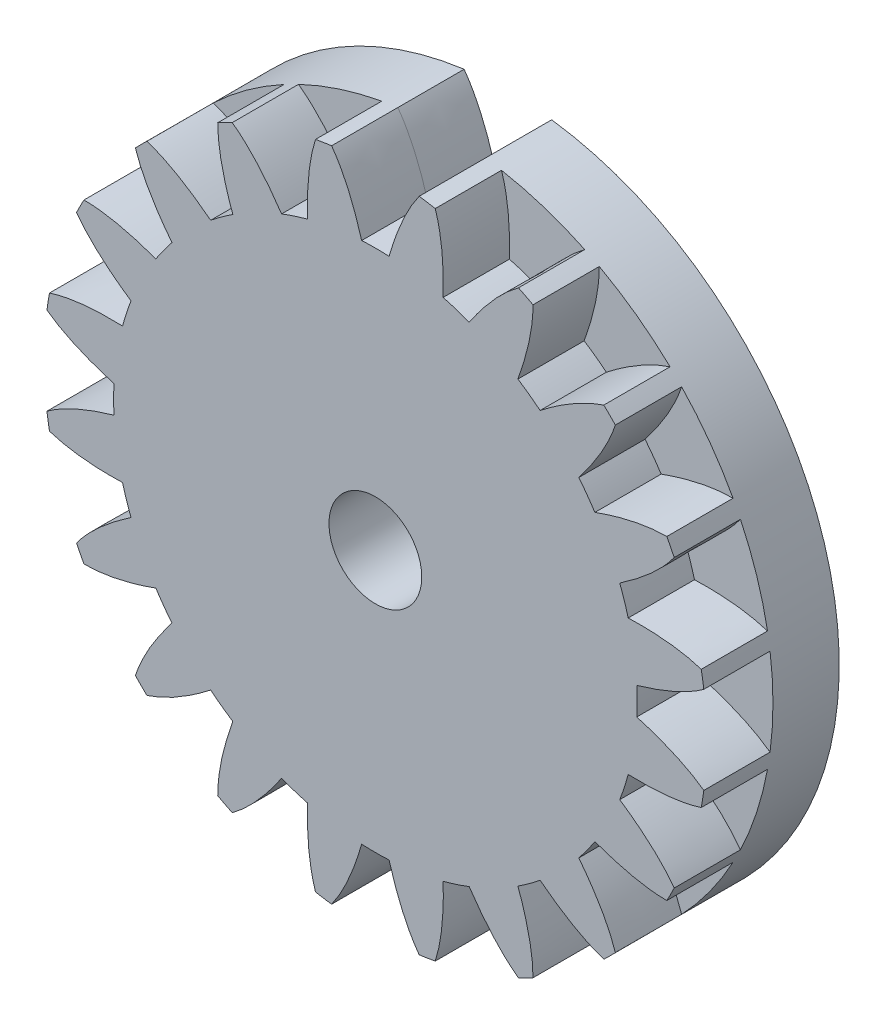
from build123d import *

# Parameters (mm, degrees)
SKETCH_3_R      = 7
EXTRUDE_1_DEPTH = 10
EXTRUDE_START   = -10
SKETCH_4_R      = 7
EXTRUDE_2_DEPTH = 10


with BuildPart() as part:
    # Sketch 3 → Extrude 1 (new body)
    with BuildSketch(Plane.XY):
        with BuildLine():
            ThreePointArc((2.067270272, 39.445866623), (0, 39.5), (-2.067270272, 39.445866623))
            add(Edge.make_bspline(
                [(-2.067270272, 39.445866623), (-3.939430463, 45.907422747), (-6.604591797, 49.561874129)],
                knots=[0, 0, 0, 1, 1, 1], degree=2))
            ThreePointArc((-6.604591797, 49.561874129), (-7.821723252, 49.38441703), (-9.034121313, 49.177074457))
            add(Edge.make_bspline(
                [(-10.223352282, 38.154070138), (-10.439552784, 44.877904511), (-9.034121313, 49.177074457)],
                knots=[0, 0, 0, 1, 1, 1], degree=2))
            ThreePointArc((-10.223352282, 38.154070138), (-12.206171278, 37.566732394), (-14.155534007, 36.876426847))
            add(Edge.make_bspline(
                [(-14.155534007, 36.876426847), (-17.932794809, 42.443202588), (-21.596801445, 45.095212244)],
                knots=[0, 0, 0, 1, 1, 1], degree=2))
            ThreePointArc((-21.596801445, 45.095212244), (-22.699524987, 44.550326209), (-23.788511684, 43.978480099))
            add(Edge.make_bspline(
                [(-21.513241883, 33.127487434), (-23.796639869, 39.455424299), (-23.788511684, 43.978480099)],
                knots=[0, 0, 0, 1, 1, 1], degree=2))
            ThreePointArc((-21.513241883, 33.127487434), (-23.217517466, 31.956171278), (-24.858155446, 30.697265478))
            add(Edge.make_bspline(
                [(-24.858155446, 30.697265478), (-30.170772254, 34.824346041), (-34.474965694, 36.214316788)],
                knots=[0, 0, 0, 1, 1, 1], degree=2))
            ThreePointArc((-34.474965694, 36.214316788), (-35.355339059, 35.355339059), (-36.214316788, 34.474965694))
            add(Edge.make_bspline(
                [(-30.697265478, 24.858155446), (-34.824346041, 30.170772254), (-36.214316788, 34.474965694)],
                knots=[0, 0, 0, 1, 1, 1], degree=2))
            ThreePointArc((-30.697265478, 24.858155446), (-31.956171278, 23.217517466), (-33.127487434, 21.513241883))
            add(Edge.make_bspline(
                [(-33.127487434, 21.513241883), (-39.455424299, 23.796639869), (-43.978480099, 23.788511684)],
                knots=[0, 0, 0, 1, 1, 1], degree=2))
            ThreePointArc((-43.978480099, 23.788511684), (-44.550326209, 22.699524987), (-45.095212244, 21.596801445))
            add(Edge.make_bspline(
                [(-36.876426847, 14.155534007), (-42.443202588, 17.932794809), (-45.095212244, 21.596801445)],
                knots=[0, 0, 0, 1, 1, 1], degree=2))
            ThreePointArc((-36.876426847, 14.155534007), (-37.566732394, 12.206171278), (-38.154070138, 10.223352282))
            add(Edge.make_bspline(
                [(-38.154070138, 10.223352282), (-44.877904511, 10.439552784), (-49.177074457, 9.034121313)],
                knots=[0, 0, 0, 1, 1, 1], degree=2))
            ThreePointArc((-49.177074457, 9.034121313), (-49.38441703, 7.821723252), (-49.561874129, 6.604591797))
            add(Edge.make_bspline(
                [(-39.445866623, 2.067270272), (-45.907422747, 3.939430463), (-49.561874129, 6.604591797)],
                knots=[0, 0, 0, 1, 1, 1], degree=2))
            ThreePointArc((-39.445866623, 2.067270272), (-39.5, 0), (-39.445866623, -2.067270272))
            add(Edge.make_bspline(
                [(-39.445866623, -2.067270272), (-45.907422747, -3.939430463), (-49.561874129, -6.604591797)],
                knots=[0, 0, 0, 1, 1, 1], degree=2))
            ThreePointArc((-49.561874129, -6.604591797), (-49.38441703, -7.821723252), (-49.177074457, -9.034121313))
            add(Edge.make_bspline(
                [(-38.154070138, -10.223352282), (-44.877904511, -10.439552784), (-49.177074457, -9.034121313)],
                knots=[0, 0, 0, 1, 1, 1], degree=2))
            ThreePointArc((-38.154070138, -10.223352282), (-37.566732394, -12.206171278), (-36.876426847, -14.155534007))
            add(Edge.make_bspline(
                [(-36.876426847, -14.155534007), (-42.443202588, -17.932794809), (-45.095212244, -21.596801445)],
                knots=[0, 0, 0, 1, 1, 1], degree=2))
            ThreePointArc((-45.095212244, -21.596801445), (-44.550326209, -22.699524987), (-43.978480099, -23.788511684))
            add(Edge.make_bspline(
                [(-33.127487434, -21.513241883), (-39.455424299, -23.796639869), (-43.978480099, -23.788511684)],
                knots=[0, 0, 0, 1, 1, 1], degree=2))
            ThreePointArc((-33.127487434, -21.513241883), (-31.956171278, -23.217517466), (-30.697265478, -24.858155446))
            add(Edge.make_bspline(
                [(-30.697265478, -24.858155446), (-34.824346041, -30.170772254), (-36.214316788, -34.474965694)],
                knots=[0, 0, 0, 1, 1, 1], degree=2))
            ThreePointArc((-36.214316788, -34.474965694), (-35.355339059, -35.355339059), (-34.474965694, -36.214316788))
            add(Edge.make_bspline(
                [(-24.858155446, -30.697265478), (-30.170772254, -34.824346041), (-34.474965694, -36.214316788)],
                knots=[0, 0, 0, 1, 1, 1], degree=2))
            ThreePointArc((-24.858155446, -30.697265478), (-23.217517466, -31.956171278), (-21.513241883, -33.127487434))
            add(Edge.make_bspline(
                [(-21.513241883, -33.127487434), (-23.796639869, -39.455424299), (-23.788511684, -43.978480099)],
                knots=[0, 0, 0, 1, 1, 1], degree=2))
            ThreePointArc((-23.788511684, -43.978480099), (-22.699524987, -44.550326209), (-21.596801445, -45.095212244))
            add(Edge.make_bspline(
                [(-14.155534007, -36.876426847), (-17.932794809, -42.443202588), (-21.596801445, -45.095212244)],
                knots=[0, 0, 0, 1, 1, 1], degree=2))
            ThreePointArc((-14.155534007, -36.876426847), (-12.206171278, -37.566732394), (-10.223352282, -38.154070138))
            add(Edge.make_bspline(
                [(-10.223352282, -38.154070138), (-10.439552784, -44.877904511), (-9.034121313, -49.177074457)],
                knots=[0, 0, 0, 1, 1, 1], degree=2))
            ThreePointArc((-9.034121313, -49.177074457), (-7.821723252, -49.38441703), (-6.604591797, -49.561874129))
            add(Edge.make_bspline(
                [(-2.067270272, -39.445866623), (-3.939430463, -45.907422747), (-6.604591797, -49.561874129)],
                knots=[0, 0, 0, 1, 1, 1], degree=2))
            ThreePointArc((-2.067270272, -39.445866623), (0, -39.5), (2.067270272, -39.445866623))
            add(Edge.make_bspline(
                [(2.067270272, -39.445866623), (3.939430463, -45.907422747), (6.604591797, -49.561874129)],
                knots=[0, 0, 0, 1, 1, 1], degree=2))
            ThreePointArc((6.604591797, -49.561874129), (7.821723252, -49.38441703), (9.034121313, -49.177074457))
            add(Edge.make_bspline(
                [(10.223352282, -38.154070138), (10.439552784, -44.877904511), (9.034121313, -49.177074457)],
                knots=[0, 0, 0, 1, 1, 1], degree=2))
            ThreePointArc((10.223352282, -38.154070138), (12.206171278, -37.566732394), (14.155534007, -36.876426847))
            add(Edge.make_bspline(
                [(14.155534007, -36.876426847), (17.932794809, -42.443202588), (21.596801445, -45.095212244)],
                knots=[0, 0, 0, 1, 1, 1], degree=2))
            ThreePointArc((21.596801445, -45.095212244), (22.699524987, -44.550326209), (23.788511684, -43.978480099))
            add(Edge.make_bspline(
                [(21.513241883, -33.127487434), (23.796639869, -39.455424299), (23.788511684, -43.978480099)],
                knots=[0, 0, 0, 1, 1, 1], degree=2))
            ThreePointArc((21.513241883, -33.127487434), (23.217517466, -31.956171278), (24.858155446, -30.697265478))
            add(Edge.make_bspline(
                [(24.858155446, -30.697265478), (30.170772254, -34.824346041), (34.474965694, -36.214316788)],
                knots=[0, 0, 0, 1, 1, 1], degree=2))
            ThreePointArc((34.474965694, -36.214316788), (35.355339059, -35.355339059), (36.214316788, -34.474965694))
            add(Edge.make_bspline(
                [(30.697265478, -24.858155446), (34.824346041, -30.170772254), (36.214316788, -34.474965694)],
                knots=[0, 0, 0, 1, 1, 1], degree=2))
            ThreePointArc((30.697265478, -24.858155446), (31.956171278, -23.217517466), (33.127487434, -21.513241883))
            add(Edge.make_bspline(
                [(33.127487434, -21.513241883), (39.455424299, -23.796639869), (43.978480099, -23.788511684)],
                knots=[0, 0, 0, 1, 1, 1], degree=2))
            ThreePointArc((43.978480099, -23.788511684), (44.550326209, -22.699524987), (45.095212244, -21.596801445))
            add(Edge.make_bspline(
                [(36.876426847, -14.155534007), (42.443202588, -17.932794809), (45.095212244, -21.596801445)],
                knots=[0, 0, 0, 1, 1, 1], degree=2))
            ThreePointArc((36.876426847, -14.155534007), (37.566732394, -12.206171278), (38.154070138, -10.223352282))
            add(Edge.make_bspline(
                [(38.154070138, -10.223352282), (44.877904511, -10.439552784), (49.177074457, -9.034121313)],
                knots=[0, 0, 0, 1, 1, 1], degree=2))
            ThreePointArc((49.177074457, -9.034121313), (49.38441703, -7.821723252), (49.561874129, -6.604591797))
            add(Edge.make_bspline(
                [(39.445866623, -2.067270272), (45.907422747, -3.939430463), (49.561874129, -6.604591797)],
                knots=[0, 0, 0, 1, 1, 1], degree=2))
            ThreePointArc((39.445866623, -2.067270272), (39.5, 0), (39.445866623, 2.067270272))
            add(Edge.make_bspline(
                [(39.445866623, 2.067270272), (45.907422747, 3.939430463), (49.561874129, 6.604591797)],
                knots=[0, 0, 0, 1, 1, 1], degree=2))
            ThreePointArc((49.561874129, 6.604591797), (49.38441703, 7.821723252), (49.177074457, 9.034121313))
            add(Edge.make_bspline(
                [(38.154070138, 10.223352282), (44.877904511, 10.439552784), (49.177074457, 9.034121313)],
                knots=[0, 0, 0, 1, 1, 1], degree=2))
            ThreePointArc((38.154070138, 10.223352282), (37.566732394, 12.206171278), (36.876426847, 14.155534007))
            add(Edge.make_bspline(
                [(36.876426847, 14.155534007), (42.443202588, 17.932794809), (45.095212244, 21.596801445)],
                knots=[0, 0, 0, 1, 1, 1], degree=2))
            ThreePointArc((45.095212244, 21.596801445), (44.550326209, 22.699524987), (43.978480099, 23.788511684))
            add(Edge.make_bspline(
                [(33.127487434, 21.513241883), (39.455424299, 23.796639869), (43.978480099, 23.788511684)],
                knots=[0, 0, 0, 1, 1, 1], degree=2))
            ThreePointArc((33.127487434, 21.513241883), (31.956171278, 23.217517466), (30.697265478, 24.858155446))
            add(Edge.make_bspline(
                [(30.697265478, 24.858155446), (34.824346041, 30.170772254), (36.214316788, 34.474965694)],
                knots=[0, 0, 0, 1, 1, 1], degree=2))
            ThreePointArc((36.214316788, 34.474965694), (35.355339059, 35.355339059), (34.474965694, 36.214316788))
            add(Edge.make_bspline(
                [(24.858155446, 30.697265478), (30.170772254, 34.824346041), (34.474965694, 36.214316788)],
                knots=[0, 0, 0, 1, 1, 1], degree=2))
            ThreePointArc((24.858155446, 30.697265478), (23.217517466, 31.956171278), (21.513241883, 33.127487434))
            add(Edge.make_bspline(
                [(21.513241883, 33.127487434), (23.796639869, 39.455424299), (23.788511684, 43.978480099)],
                knots=[0, 0, 0, 1, 1, 1], degree=2))
            ThreePointArc((23.788511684, 43.978480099), (22.699524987, 44.550326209), (21.596801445, 45.095212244))
            add(Edge.make_bspline(
                [(14.155534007, 36.876426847), (17.932794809, 42.443202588), (21.596801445, 45.095212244)],
                knots=[0, 0, 0, 1, 1, 1], degree=2))
            ThreePointArc((14.155534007, 36.876426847), (12.206171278, 37.566732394), (10.223352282, 38.154070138))
            add(Edge.make_bspline(
                [(10.223352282, 38.154070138), (10.439552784, 44.877904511), (9.034121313, 49.177074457)],
                knots=[0, 0, 0, 1, 1, 1], degree=2))
            ThreePointArc((9.034121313, 49.177074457), (7.821723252, 49.38441703), (6.604591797, 49.561874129))
            add(Edge.make_bspline(
                [(2.067270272, 39.445866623), (3.939430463, 45.907422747), (6.604591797, 49.561874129)],
                knots=[0, 0, 0, 1, 1, 1], degree=2))
        make_face()
        Circle(SKETCH_3_R, mode=Mode.SUBTRACT)
    extrude(amount=EXTRUDE_1_DEPTH)

    # Sketch 4 → Extrude 2 (add)
    with BuildSketch(Plane.XY.offset(EXTRUDE_START)):
        with BuildLine():
            ThreePointArc((2.067270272, 39.445866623), (0, 39.5), (-2.067270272, 39.445866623))
            add(Edge.make_bspline(
                [(-2.067270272, 39.445866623), (-3.939430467, 45.907422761), (-6.604591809, 49.561874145)],
                knots=[0, 0, 0, 1, 1, 1], degree=2))
            ThreePointArc((-6.604591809, 49.561874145), (5e-09, -50.000000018), (6.604591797, 49.561874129))
            add(Edge.make_bspline(
                [(6.604591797, 49.561874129), (3.939430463, 45.907422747), (2.067270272, 39.445866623)],
                knots=[0, 0, 0, 1, 1, 1], degree=2))
        make_face()
        Circle(SKETCH_4_R, mode=Mode.SUBTRACT)
    extrude(amount=EXTRUDE_2_DEPTH)


solid = part.part
